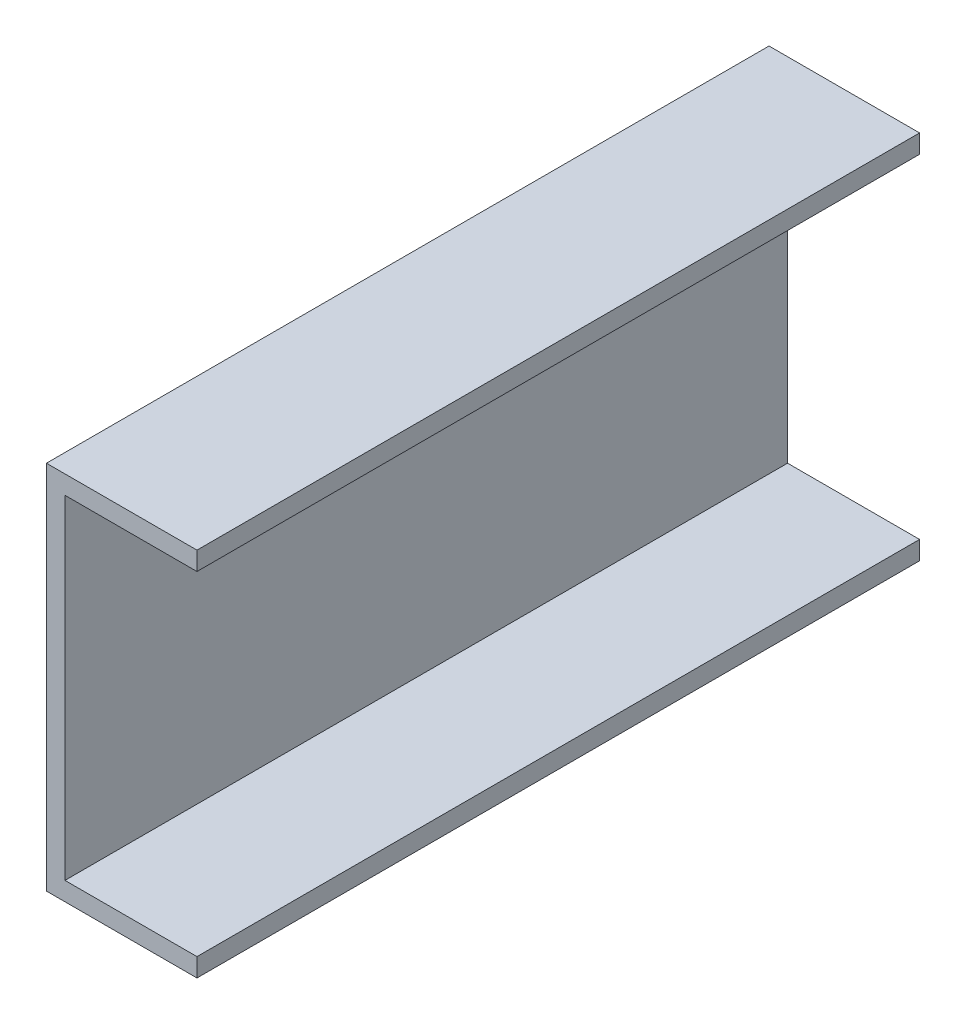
from build123d import *

# Parameters (mm, degrees)
BOSS_EXTRUDE1_DEPTH = 312


with BuildPart() as part:
    # Sketch1 → Boss-Extrude1 (new body)
    with BuildSketch(Plane.XY):
        Polygon((65, 0), (0, 0), (0, 160), (65, 160), (65, 152), (8, 152), (8, 8), (65, 8), align=None)
    extrude(amount=BOSS_EXTRUDE1_DEPTH)


solid = part.part
